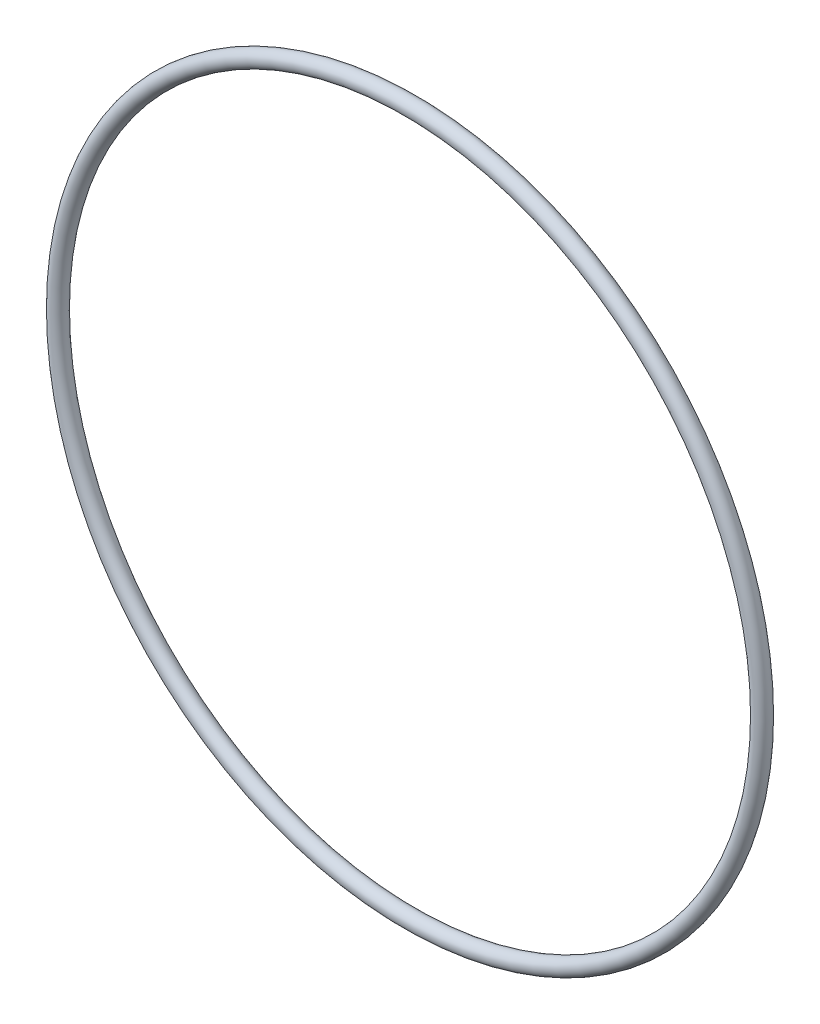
ISO-10303-21;
HEADER;
FILE_DESCRIPTION(('STEP AP214'),'2;1');
FILE_NAME('part.step','',(''),(''),'','','');
FILE_SCHEMA(('AUTOMOTIVE_DESIGN { 1 0 10303 214 1 1 1 1 }'));
ENDSEC;
DATA;
#1=APPLICATION_CONTEXT('core data for automotive mechanical design processes');
#2=APPLICATION_PROTOCOL_DEFINITION('international standard','automotive_design',2000,#1);
#3=PRODUCT_CONTEXT('',#1,'mechanical');
#4=PRODUCT('Part','Part','',(#3));
#5=PRODUCT_RELATED_PRODUCT_CATEGORY('part','',(#4));
#6=PRODUCT_DEFINITION_FORMATION('','',#4);
#7=PRODUCT_DEFINITION_CONTEXT('part definition',#1,'design');
#8=PRODUCT_DEFINITION('design','',#6,#7);
#9=PRODUCT_DEFINITION_SHAPE('','',#8);
#10=(LENGTH_UNIT() NAMED_UNIT(*) SI_UNIT(.MILLI.,.METRE.));
#11=(NAMED_UNIT(*) PLANE_ANGLE_UNIT() SI_UNIT($,.RADIAN.));
#12=(NAMED_UNIT(*) SI_UNIT($,.STERADIAN.) SOLID_ANGLE_UNIT());
#13=UNCERTAINTY_MEASURE_WITH_UNIT(LENGTH_MEASURE(1.E-05),#10,'distance_accuracy_value','');
#14=(GEOMETRIC_REPRESENTATION_CONTEXT(3) GLOBAL_UNCERTAINTY_ASSIGNED_CONTEXT((#13)) GLOBAL_UNIT_ASSIGNED_CONTEXT((#10,
#11,#12)) REPRESENTATION_CONTEXT('',''));
#15=CARTESIAN_POINT('',(0.,0.,0.));
#16=DIRECTION('',(0.,0.,1.));
#17=DIRECTION('',(1.,0.,0.));
#18=AXIS2_PLACEMENT_3D('',#15,#16,#17);
#19=CARTESIAN_POINT('',(38.39045,0.,0.));
#20=DIRECTION('',(0.,0.,-1.));
#21=DIRECTION('',(-1.,0.,0.));
#22=AXIS2_PLACEMENT_3D('',#19,#20,#21);
#23=TOROIDAL_SURFACE('',#22,38.39045,0.889);
#24=CARTESIAN_POINT('',(-0.889000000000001,0.,0.));
#25=VERTEX_POINT('',#24);
#26=VERTEX_LOOP('',#25);
#27=FACE_BOUND('',#26,.T.);
#28=ADVANCED_FACE('F28',(#27),#23,.T.);
#29=CLOSED_SHELL('',(#28));
#30=MANIFOLD_SOLID_BREP('B2',#29);
#31=ADVANCED_BREP_SHAPE_REPRESENTATION('',(#18,#30),#14);
#32=SHAPE_DEFINITION_REPRESENTATION(#9,#31);
ENDSEC;
END-ISO-10303-21;
